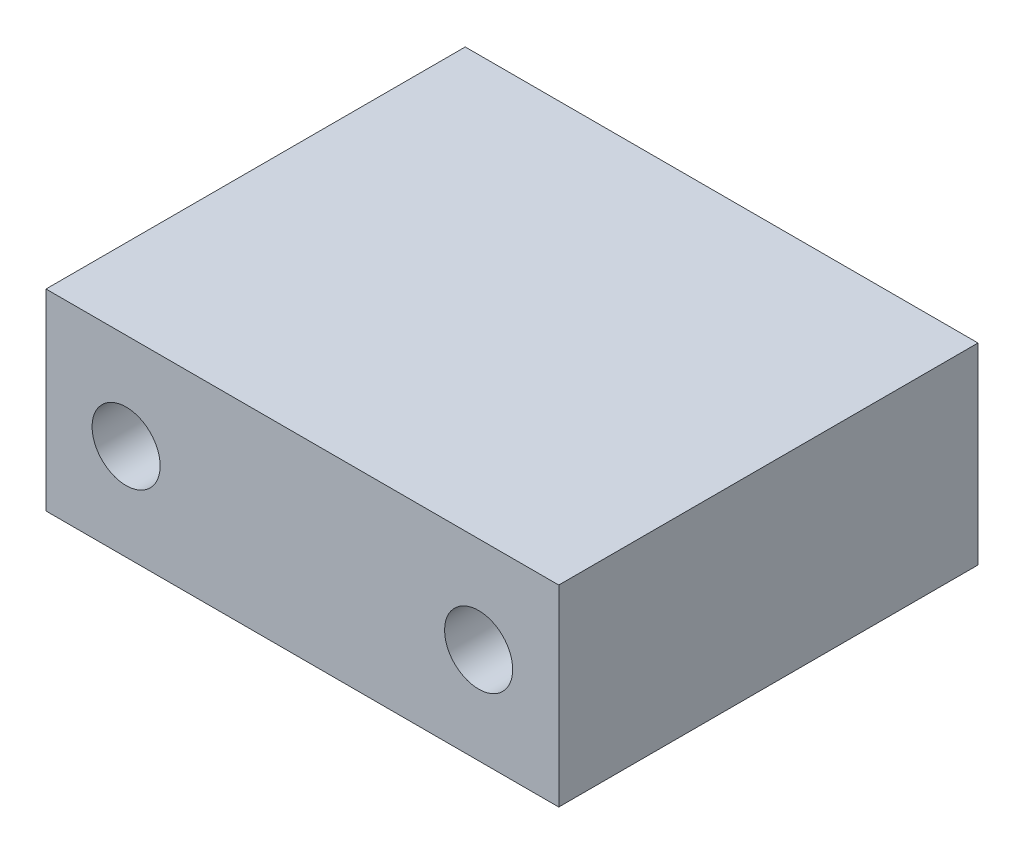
from build123d import *

# Parameters (mm, degrees)
SKETCH1_W                                        = 101.6
SKETCH1_H                                        = 38.1
BOSS_EXTRUDE1_DEPTH                              = 84.6582
CBORE_FOR_1_2_SOCKET_HEAD_CAP_SCREW1_D           = 13.49248
CBORE_FOR_1_2_SOCKET_HEAD_CAP_SCREW1_CBORE_D     = 20.6375
CBORE_FOR_1_2_SOCKET_HEAD_CAP_SCREW1_CBORE_DEPTH = 13.97
CHAMFER1_SIZE                                    = 1.5875


with BuildPart() as part:
    # Sketch1 → Boss-Extrude1 (new body)
    with BuildSketch(Plane.XY.offset(84.6582)):
        with Locations((-838.2, -241.3)):
            Rectangle(SKETCH1_W, SKETCH1_H)
    extrude(amount=-BOSS_EXTRUDE1_DEPTH)

    # CBORE for 1_2 Socket Head Cap Screw1 (through all)
    with Locations(Plane(origin=(0, 0, 0), x_dir=(-1, 0, 0), z_dir=(0, 0, -1))):
        with Locations((803.275, -241.3), (873.125, -241.3)):
            CounterBoreHole(CBORE_FOR_1_2_SOCKET_HEAD_CAP_SCREW1_D / 2, CBORE_FOR_1_2_SOCKET_HEAD_CAP_SCREW1_CBORE_D / 2, CBORE_FOR_1_2_SOCKET_HEAD_CAP_SCREW1_CBORE_DEPTH)

    # Chamfer1
    chamfer1_edges = [part.edges().sort_by_distance(p)[0] for p in [
        (-787.4, -241.3, 0),
        (-838.2, -222.25, 0),
        (-889, -241.3, 0),
        (-838.2, -260.35, 0),
    ]]
    chamfer(chamfer1_edges, length=CHAMFER1_SIZE)


solid = part.part
